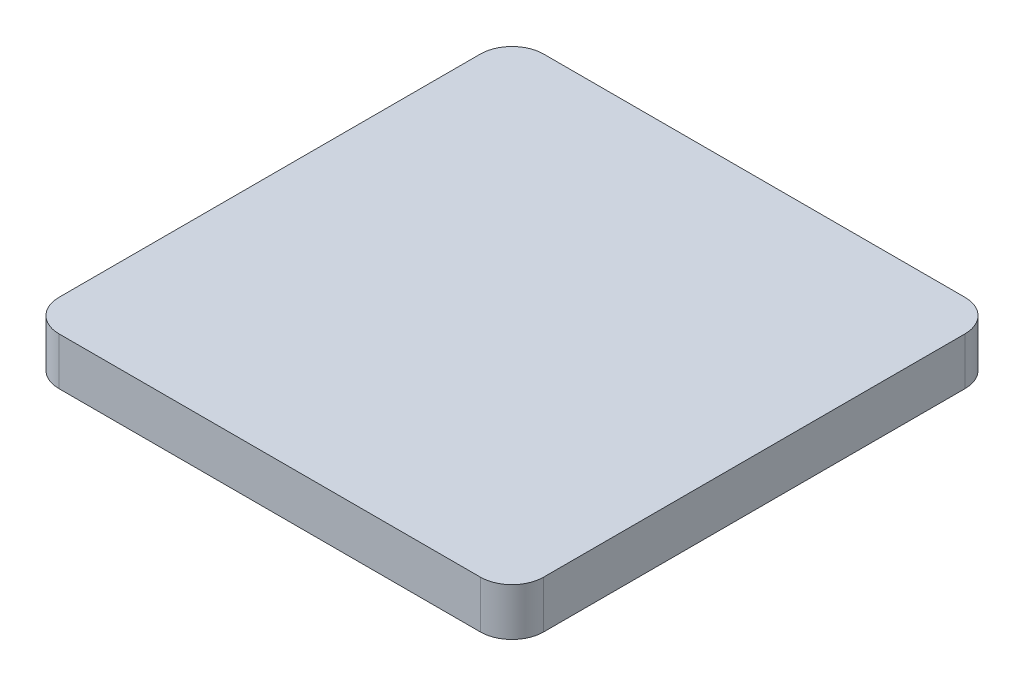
ISO-10303-21;
HEADER;
FILE_DESCRIPTION(('STEP AP214'),'2;1');
FILE_NAME('part.step','',(''),(''),'','','');
FILE_SCHEMA(('AUTOMOTIVE_DESIGN { 1 0 10303 214 1 1 1 1 }'));
ENDSEC;
DATA;
#1=APPLICATION_CONTEXT('core data for automotive mechanical design processes');
#2=APPLICATION_PROTOCOL_DEFINITION('international standard','automotive_design',2000,#1);
#3=PRODUCT_CONTEXT('',#1,'mechanical');
#4=PRODUCT('Part','Part','',(#3));
#5=PRODUCT_RELATED_PRODUCT_CATEGORY('part','',(#4));
#6=PRODUCT_DEFINITION_FORMATION('','',#4);
#7=PRODUCT_DEFINITION_CONTEXT('part definition',#1,'design');
#8=PRODUCT_DEFINITION('design','',#6,#7);
#9=PRODUCT_DEFINITION_SHAPE('','',#8);
#10=(LENGTH_UNIT() NAMED_UNIT(*) SI_UNIT(.MILLI.,.METRE.));
#11=(NAMED_UNIT(*) PLANE_ANGLE_UNIT() SI_UNIT($,.RADIAN.));
#12=(NAMED_UNIT(*) SI_UNIT($,.STERADIAN.) SOLID_ANGLE_UNIT());
#13=UNCERTAINTY_MEASURE_WITH_UNIT(LENGTH_MEASURE(1.E-05),#10,'distance_accuracy_value','');
#14=(GEOMETRIC_REPRESENTATION_CONTEXT(3) GLOBAL_UNCERTAINTY_ASSIGNED_CONTEXT((#13)) GLOBAL_UNIT_ASSIGNED_CONTEXT((#10,
#11,#12)) REPRESENTATION_CONTEXT('',''));
#15=CARTESIAN_POINT('',(0.,0.,0.));
#16=DIRECTION('',(0.,0.,1.));
#17=DIRECTION('',(1.,0.,0.));
#18=AXIS2_PLACEMENT_3D('',#15,#16,#17);
#19=CARTESIAN_POINT('',(7.65,1.5,-7.65));
#20=DIRECTION('',(-1.,0.,0.));
#21=DIRECTION('',(0.,0.,1.));
#22=AXIS2_PLACEMENT_3D('',#19,#20,#21);
#23=PLANE('',#22);
#24=DIRECTION('',(0.,0.,-1.));
#25=VECTOR('',#24,1.);
#26=CARTESIAN_POINT('',(7.65,0.,-7.65));
#27=LINE('',#26,#25);
#28=CARTESIAN_POINT('',(7.65,0.,6.65));
#29=VERTEX_POINT('',#28);
#30=CARTESIAN_POINT('',(7.65,0.,-6.65));
#31=VERTEX_POINT('',#30);
#32=EDGE_CURVE('E140',#29,#31,#27,.T.);
#33=ORIENTED_EDGE('',*,*,#32,.T.);
#34=DIRECTION('',(0.,-1.,0.));
#35=VECTOR('',#34,1.);
#36=CARTESIAN_POINT('',(7.65,1.5,-6.65));
#37=LINE('',#36,#35);
#38=CARTESIAN_POINT('',(7.65,1.5,-6.65));
#39=VERTEX_POINT('',#38);
#40=EDGE_CURVE('E173',#31,#39,#37,.F.);
#41=ORIENTED_EDGE('',*,*,#40,.T.);
#42=DIRECTION('',(0.,0.,-1.));
#43=VECTOR('',#42,1.);
#44=CARTESIAN_POINT('',(7.65,1.5,-7.65));
#45=LINE('',#44,#43);
#46=CARTESIAN_POINT('',(7.65,1.5,6.65));
#47=VERTEX_POINT('',#46);
#48=EDGE_CURVE('E137',#47,#39,#45,.T.);
#49=ORIENTED_EDGE('',*,*,#48,.F.);
#50=DIRECTION('',(0.,-1.,0.));
#51=VECTOR('',#50,1.);
#52=CARTESIAN_POINT('',(7.65,1.5,6.65));
#53=LINE('',#52,#51);
#54=EDGE_CURVE('E169',#47,#29,#53,.T.);
#55=ORIENTED_EDGE('',*,*,#54,.T.);
#56=EDGE_LOOP('',(#33,#41,#49,#55));
#57=FACE_BOUND('',#56,.T.);
#58=ADVANCED_FACE('F38',(#57),#23,.F.);
#59=CARTESIAN_POINT('',(-7.65,1.5,-7.65));
#60=DIRECTION('',(0.,0.,1.));
#61=DIRECTION('',(1.,0.,0.));
#62=AXIS2_PLACEMENT_3D('',#59,#60,#61);
#63=PLANE('',#62);
#64=DIRECTION('',(-1.,0.,0.));
#65=VECTOR('',#64,1.);
#66=CARTESIAN_POINT('',(-7.65,0.,-7.65));
#67=LINE('',#66,#65);
#68=CARTESIAN_POINT('',(6.65,0.,-7.65));
#69=VERTEX_POINT('',#68);
#70=CARTESIAN_POINT('',(-6.65,0.,-7.65));
#71=VERTEX_POINT('',#70);
#72=EDGE_CURVE('E133',#69,#71,#67,.T.);
#73=ORIENTED_EDGE('',*,*,#72,.T.);
#74=DIRECTION('',(0.,-1.,0.));
#75=VECTOR('',#74,1.);
#76=CARTESIAN_POINT('',(-6.65,1.5,-7.65));
#77=LINE('',#76,#75);
#78=CARTESIAN_POINT('',(-6.65,1.5,-7.65));
#79=VERTEX_POINT('',#78);
#80=EDGE_CURVE('E109',#71,#79,#77,.F.);
#81=ORIENTED_EDGE('',*,*,#80,.T.);
#82=DIRECTION('',(-1.,0.,0.));
#83=VECTOR('',#82,1.);
#84=CARTESIAN_POINT('',(-7.65,1.5,-7.65));
#85=LINE('',#84,#83);
#86=CARTESIAN_POINT('',(6.65,1.5,-7.65));
#87=VERTEX_POINT('',#86);
#88=EDGE_CURVE('E192',#87,#79,#85,.T.);
#89=ORIENTED_EDGE('',*,*,#88,.F.);
#90=DIRECTION('',(0.,-1.,0.));
#91=VECTOR('',#90,1.);
#92=CARTESIAN_POINT('',(6.65,1.5,-7.65));
#93=LINE('',#92,#91);
#94=EDGE_CURVE('E115',#87,#69,#93,.T.);
#95=ORIENTED_EDGE('',*,*,#94,.T.);
#96=EDGE_LOOP('',(#73,#81,#89,#95));
#97=FACE_BOUND('',#96,.T.);
#98=ADVANCED_FACE('F213',(#97),#63,.F.);
#99=CARTESIAN_POINT('',(-7.65,1.5,-7.65));
#100=DIRECTION('',(1.,0.,0.));
#101=DIRECTION('',(0.,0.,-1.));
#102=AXIS2_PLACEMENT_3D('',#99,#100,#101);
#103=PLANE('',#102);
#104=DIRECTION('',(0.,0.,1.));
#105=VECTOR('',#104,1.);
#106=CARTESIAN_POINT('',(-7.65,1.5,-7.65));
#107=LINE('',#106,#105);
#108=CARTESIAN_POINT('',(-7.65,1.5,-6.65));
#109=VERTEX_POINT('',#108);
#110=CARTESIAN_POINT('',(-7.65,1.5,6.65));
#111=VERTEX_POINT('',#110);
#112=EDGE_CURVE('E124',#109,#111,#107,.T.);
#113=ORIENTED_EDGE('',*,*,#112,.F.);
#114=DIRECTION('',(0.,-1.,0.));
#115=VECTOR('',#114,1.);
#116=CARTESIAN_POINT('',(-7.65,1.5,-6.65));
#117=LINE('',#116,#115);
#118=CARTESIAN_POINT('',(-7.65,0.,-6.65));
#119=VERTEX_POINT('',#118);
#120=EDGE_CURVE('E108',#109,#119,#117,.T.);
#121=ORIENTED_EDGE('',*,*,#120,.T.);
#122=DIRECTION('',(0.,0.,1.));
#123=VECTOR('',#122,1.);
#124=CARTESIAN_POINT('',(-7.65,0.,-7.65));
#125=LINE('',#124,#123);
#126=CARTESIAN_POINT('',(-7.65,0.,6.65));
#127=VERTEX_POINT('',#126);
#128=EDGE_CURVE('E122',#119,#127,#125,.T.);
#129=ORIENTED_EDGE('',*,*,#128,.T.);
#130=DIRECTION('',(0.,-1.,0.));
#131=VECTOR('',#130,1.);
#132=CARTESIAN_POINT('',(-7.65,1.5,6.65));
#133=LINE('',#132,#131);
#134=EDGE_CURVE('E127',#127,#111,#133,.F.);
#135=ORIENTED_EDGE('',*,*,#134,.T.);
#136=EDGE_LOOP('',(#113,#121,#129,#135));
#137=FACE_BOUND('',#136,.T.);
#138=ADVANCED_FACE('F121',(#137),#103,.F.);
#139=CARTESIAN_POINT('',(-7.65,1.5,7.65));
#140=DIRECTION('',(0.,0.,-1.));
#141=DIRECTION('',(-1.,0.,0.));
#142=AXIS2_PLACEMENT_3D('',#139,#140,#141);
#143=PLANE('',#142);
#144=DIRECTION('',(1.,0.,0.));
#145=VECTOR('',#144,1.);
#146=CARTESIAN_POINT('',(-7.65,0.,7.65));
#147=LINE('',#146,#145);
#148=CARTESIAN_POINT('',(-6.65,0.,7.65));
#149=VERTEX_POINT('',#148);
#150=CARTESIAN_POINT('',(6.65,0.,7.65));
#151=VERTEX_POINT('',#150);
#152=EDGE_CURVE('E132',#149,#151,#147,.T.);
#153=ORIENTED_EDGE('',*,*,#152,.T.);
#154=DIRECTION('',(0.,-1.,0.));
#155=VECTOR('',#154,1.);
#156=CARTESIAN_POINT('',(6.65,1.5,7.65));
#157=LINE('',#156,#155);
#158=CARTESIAN_POINT('',(6.65,1.5,7.65));
#159=VERTEX_POINT('',#158);
#160=EDGE_CURVE('E11',#151,#159,#157,.F.);
#161=ORIENTED_EDGE('',*,*,#160,.T.);
#162=DIRECTION('',(1.,0.,0.));
#163=VECTOR('',#162,1.);
#164=CARTESIAN_POINT('',(-7.65,1.5,7.65));
#165=LINE('',#164,#163);
#166=CARTESIAN_POINT('',(-6.65,1.5,7.65));
#167=VERTEX_POINT('',#166);
#168=EDGE_CURVE('E145',#167,#159,#165,.T.);
#169=ORIENTED_EDGE('',*,*,#168,.F.);
#170=DIRECTION('',(0.,-1.,0.));
#171=VECTOR('',#170,1.);
#172=CARTESIAN_POINT('',(-6.65,1.5,7.65));
#173=LINE('',#172,#171);
#174=EDGE_CURVE('E47',#167,#149,#173,.T.);
#175=ORIENTED_EDGE('',*,*,#174,.T.);
#176=EDGE_LOOP('',(#153,#161,#169,#175));
#177=FACE_BOUND('',#176,.T.);
#178=ADVANCED_FACE('F178',(#177),#143,.F.);
#179=CARTESIAN_POINT('',(0.,1.5,0.));
#180=DIRECTION('',(0.,1.,0.));
#181=DIRECTION('',(0.,0.,1.));
#182=AXIS2_PLACEMENT_3D('',#179,#180,#181);
#183=PLANE('',#182);
#184=ORIENTED_EDGE('',*,*,#88,.T.);
#185=CARTESIAN_POINT('',(-6.65,1.5,-6.65));
#186=DIRECTION('',(0.,1.,0.));
#187=DIRECTION('',(0.,0.,1.));
#188=AXIS2_PLACEMENT_3D('',#185,#186,#187);
#189=CIRCLE('',#188,1.);
#190=EDGE_CURVE('E166',#79,#109,#189,.T.);
#191=ORIENTED_EDGE('',*,*,#190,.T.);
#192=ORIENTED_EDGE('',*,*,#112,.T.);
#193=CARTESIAN_POINT('',(-6.65,1.5,6.65));
#194=DIRECTION('',(0.,1.,0.));
#195=DIRECTION('',(0.,0.,1.));
#196=AXIS2_PLACEMENT_3D('',#193,#194,#195);
#197=CIRCLE('',#196,1.);
#198=EDGE_CURVE('E59',#111,#167,#197,.T.);
#199=ORIENTED_EDGE('',*,*,#198,.T.);
#200=ORIENTED_EDGE('',*,*,#168,.T.);
#201=CARTESIAN_POINT('',(6.65,1.5,6.65));
#202=DIRECTION('',(0.,1.,0.));
#203=DIRECTION('',(0.,0.,1.));
#204=AXIS2_PLACEMENT_3D('',#201,#202,#203);
#205=CIRCLE('',#204,1.);
#206=EDGE_CURVE('E160',#159,#47,#205,.T.);
#207=ORIENTED_EDGE('',*,*,#206,.T.);
#208=ORIENTED_EDGE('',*,*,#48,.T.);
#209=CARTESIAN_POINT('',(6.65,1.5,-6.65));
#210=DIRECTION('',(0.,1.,0.));
#211=DIRECTION('',(0.,0.,1.));
#212=AXIS2_PLACEMENT_3D('',#209,#210,#211);
#213=CIRCLE('',#212,1.);
#214=EDGE_CURVE('E163',#39,#87,#213,.T.);
#215=ORIENTED_EDGE('',*,*,#214,.T.);
#216=EDGE_LOOP('',(#184,#191,#192,#199,#200,#207,#208,#215));
#217=FACE_BOUND('',#216,.T.);
#218=ADVANCED_FACE('F202',(#217),#183,.T.);
#219=CARTESIAN_POINT('',(0.,0.,0.));
#220=DIRECTION('',(0.,1.,0.));
#221=DIRECTION('',(0.,0.,1.));
#222=AXIS2_PLACEMENT_3D('',#219,#220,#221);
#223=PLANE('',#222);
#224=ORIENTED_EDGE('',*,*,#128,.F.);
#225=CARTESIAN_POINT('',(-6.65,0.,-6.65));
#226=DIRECTION('',(0.,1.,0.));
#227=DIRECTION('',(0.,0.,1.));
#228=AXIS2_PLACEMENT_3D('',#225,#226,#227);
#229=CIRCLE('',#228,1.);
#230=EDGE_CURVE('E104',#119,#71,#229,.F.);
#231=ORIENTED_EDGE('',*,*,#230,.T.);
#232=ORIENTED_EDGE('',*,*,#72,.F.);
#233=CARTESIAN_POINT('',(6.65,0.,-6.65));
#234=DIRECTION('',(0.,1.,0.));
#235=DIRECTION('',(0.,0.,1.));
#236=AXIS2_PLACEMENT_3D('',#233,#234,#235);
#237=CIRCLE('',#236,1.);
#238=EDGE_CURVE('E116',#69,#31,#237,.F.);
#239=ORIENTED_EDGE('',*,*,#238,.T.);
#240=ORIENTED_EDGE('',*,*,#32,.F.);
#241=CARTESIAN_POINT('',(6.65,0.,6.65));
#242=DIRECTION('',(0.,1.,0.));
#243=DIRECTION('',(0.,0.,1.));
#244=AXIS2_PLACEMENT_3D('',#241,#242,#243);
#245=CIRCLE('',#244,1.);
#246=EDGE_CURVE('E149',#29,#151,#245,.F.);
#247=ORIENTED_EDGE('',*,*,#246,.T.);
#248=ORIENTED_EDGE('',*,*,#152,.F.);
#249=CARTESIAN_POINT('',(-6.65,0.,6.65));
#250=DIRECTION('',(0.,1.,0.));
#251=DIRECTION('',(0.,0.,1.));
#252=AXIS2_PLACEMENT_3D('',#249,#250,#251);
#253=CIRCLE('',#252,1.);
#254=EDGE_CURVE('E126',#149,#127,#253,.F.);
#255=ORIENTED_EDGE('',*,*,#254,.T.);
#256=EDGE_LOOP('',(#224,#231,#232,#239,#240,#247,#248,#255));
#257=FACE_BOUND('',#256,.T.);
#258=ADVANCED_FACE('F129',(#257),#223,.F.);
#259=CARTESIAN_POINT('',(-6.65,1.5,-6.65));
#260=DIRECTION('',(0.,-1.,0.));
#261=DIRECTION('',(0.,0.,-1.));
#262=AXIS2_PLACEMENT_3D('',#259,#260,#261);
#263=CYLINDRICAL_SURFACE('',#262,1.);
#264=ORIENTED_EDGE('',*,*,#190,.F.);
#265=ORIENTED_EDGE('',*,*,#80,.F.);
#266=ORIENTED_EDGE('',*,*,#230,.F.);
#267=ORIENTED_EDGE('',*,*,#120,.F.);
#268=EDGE_LOOP('',(#264,#265,#266,#267));
#269=FACE_BOUND('',#268,.T.);
#270=ADVANCED_FACE('F107',(#269),#263,.T.);
#271=CARTESIAN_POINT('',(6.65,1.5,-6.65));
#272=DIRECTION('',(0.,-1.,0.));
#273=DIRECTION('',(0.,0.,-1.));
#274=AXIS2_PLACEMENT_3D('',#271,#272,#273);
#275=CYLINDRICAL_SURFACE('',#274,1.);
#276=ORIENTED_EDGE('',*,*,#214,.F.);
#277=ORIENTED_EDGE('',*,*,#40,.F.);
#278=ORIENTED_EDGE('',*,*,#238,.F.);
#279=ORIENTED_EDGE('',*,*,#94,.F.);
#280=EDGE_LOOP('',(#276,#277,#278,#279));
#281=FACE_BOUND('',#280,.T.);
#282=ADVANCED_FACE('F224',(#281),#275,.T.);
#283=CARTESIAN_POINT('',(6.65,1.5,6.65));
#284=DIRECTION('',(0.,-1.,0.));
#285=DIRECTION('',(0.,0.,-1.));
#286=AXIS2_PLACEMENT_3D('',#283,#284,#285);
#287=CYLINDRICAL_SURFACE('',#286,1.);
#288=ORIENTED_EDGE('',*,*,#206,.F.);
#289=ORIENTED_EDGE('',*,*,#160,.F.);
#290=ORIENTED_EDGE('',*,*,#246,.F.);
#291=ORIENTED_EDGE('',*,*,#54,.F.);
#292=EDGE_LOOP('',(#288,#289,#290,#291));
#293=FACE_BOUND('',#292,.T.);
#294=ADVANCED_FACE('F185',(#293),#287,.T.);
#295=CARTESIAN_POINT('',(-6.65,1.5,6.65));
#296=DIRECTION('',(0.,-1.,0.));
#297=DIRECTION('',(0.,0.,-1.));
#298=AXIS2_PLACEMENT_3D('',#295,#296,#297);
#299=CYLINDRICAL_SURFACE('',#298,1.);
#300=ORIENTED_EDGE('',*,*,#198,.F.);
#301=ORIENTED_EDGE('',*,*,#134,.F.);
#302=ORIENTED_EDGE('',*,*,#254,.F.);
#303=ORIENTED_EDGE('',*,*,#174,.F.);
#304=EDGE_LOOP('',(#300,#301,#302,#303));
#305=FACE_BOUND('',#304,.T.);
#306=ADVANCED_FACE('F40',(#305),#299,.T.);
#307=CLOSED_SHELL('',(#58,#98,#138,#178,#218,#258,#270,#282,#294,#306));
#308=MANIFOLD_SOLID_BREP('B2',#307);
#309=ADVANCED_BREP_SHAPE_REPRESENTATION('',(#18,#308),#14);
#310=SHAPE_DEFINITION_REPRESENTATION(#9,#309);
ENDSEC;
END-ISO-10303-21;
